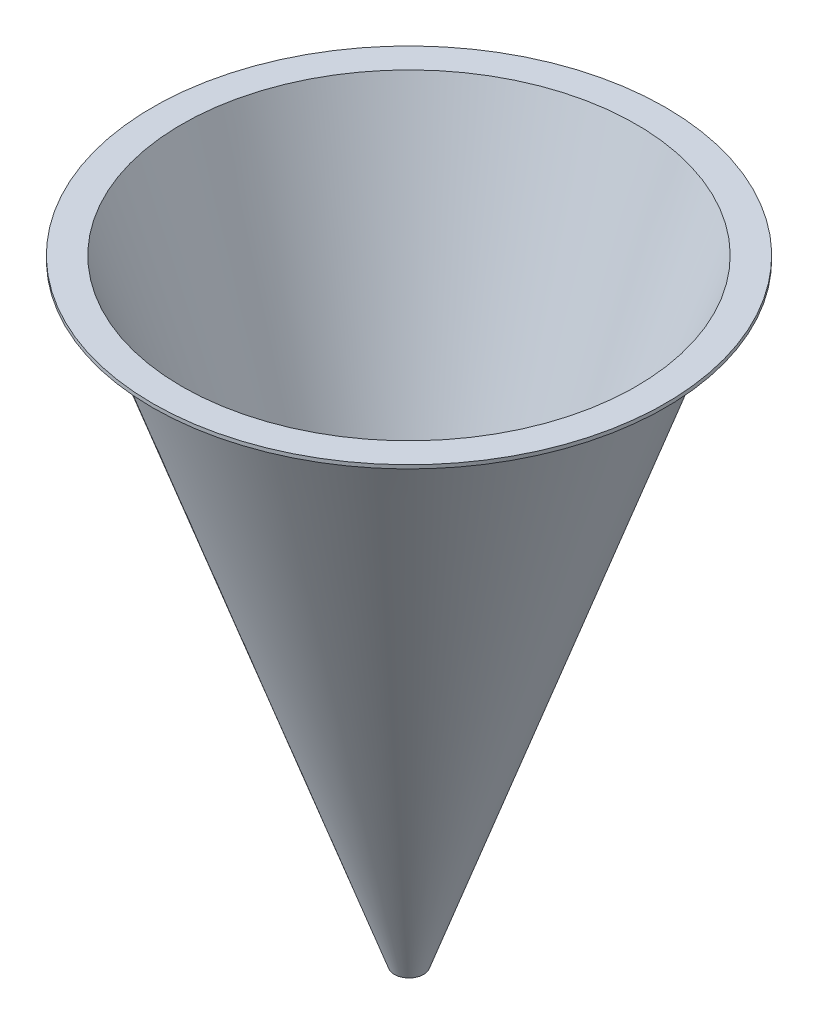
ISO-10303-21;
HEADER;
FILE_DESCRIPTION(('STEP AP214'),'2;1');
FILE_NAME('part.step','',(''),(''),'','','');
FILE_SCHEMA(('AUTOMOTIVE_DESIGN { 1 0 10303 214 1 1 1 1 }'));
ENDSEC;
DATA;
#1=APPLICATION_CONTEXT('core data for automotive mechanical design processes');
#2=APPLICATION_PROTOCOL_DEFINITION('international standard','automotive_design',2000,#1);
#3=PRODUCT_CONTEXT('',#1,'mechanical');
#4=PRODUCT('Part','Part','',(#3));
#5=PRODUCT_RELATED_PRODUCT_CATEGORY('part','',(#4));
#6=PRODUCT_DEFINITION_FORMATION('','',#4);
#7=PRODUCT_DEFINITION_CONTEXT('part definition',#1,'design');
#8=PRODUCT_DEFINITION('design','',#6,#7);
#9=PRODUCT_DEFINITION_SHAPE('','',#8);
#10=(LENGTH_UNIT() NAMED_UNIT(*) SI_UNIT(.MILLI.,.METRE.));
#11=(NAMED_UNIT(*) PLANE_ANGLE_UNIT() SI_UNIT($,.RADIAN.));
#12=(NAMED_UNIT(*) SI_UNIT($,.STERADIAN.) SOLID_ANGLE_UNIT());
#13=UNCERTAINTY_MEASURE_WITH_UNIT(LENGTH_MEASURE(1.E-05),#10,'distance_accuracy_value','');
#14=(GEOMETRIC_REPRESENTATION_CONTEXT(3) GLOBAL_UNCERTAINTY_ASSIGNED_CONTEXT((#13)) GLOBAL_UNIT_ASSIGNED_CONTEXT((#10,
#11,#12)) REPRESENTATION_CONTEXT('',''));
#15=CARTESIAN_POINT('',(0.,0.,0.));
#16=DIRECTION('',(0.,0.,1.));
#17=DIRECTION('',(1.,0.,0.));
#18=AXIS2_PLACEMENT_3D('',#15,#16,#17);
#19=CARTESIAN_POINT('',(0.,69.3998665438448,0.));
#20=DIRECTION('',(0.,1.,0.));
#21=DIRECTION('',(0.,0.,1.));
#22=AXIS2_PLACEMENT_3D('',#19,#20,#21);
#23=CYLINDRICAL_SURFACE('',#22,444.5);
#24=CARTESIAN_POINT('',(0.,0.,0.));
#25=DIRECTION('',(0.,1.,0.));
#26=DIRECTION('',(0.,0.,1.));
#27=AXIS2_PLACEMENT_3D('',#24,#25,#26);
#28=CIRCLE('',#27,444.5);
#29=CARTESIAN_POINT('',(0.,0.,444.5));
#30=VERTEX_POINT('',#29);
#31=EDGE_CURVE('E55',#30,#30,#28,.T.);
#32=ORIENTED_EDGE('',*,*,#31,.F.);
#33=EDGE_LOOP('',(#32));
#34=FACE_BOUND('',#33,.T.);
#35=CARTESIAN_POINT('',(0.,-6.35000000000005,0.));
#36=DIRECTION('',(0.,1.,0.));
#37=DIRECTION('',(0.,0.,1.));
#38=AXIS2_PLACEMENT_3D('',#35,#36,#37);
#39=CIRCLE('',#38,444.5);
#40=CARTESIAN_POINT('',(0.,-6.35000000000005,444.5));
#41=VERTEX_POINT('',#40);
#42=EDGE_CURVE('E10',#41,#41,#39,.T.);
#43=ORIENTED_EDGE('',*,*,#42,.T.);
#44=EDGE_LOOP('',(#43));
#45=FACE_BOUND('',#44,.T.);
#46=ADVANCED_FACE('F33',(#34,#45),#23,.T.);
#47=CARTESIAN_POINT('',(400.05,-6.35000000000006,0.));
#48=DIRECTION('',(0.,1.,0.));
#49=DIRECTION('',(0.,0.,1.));
#50=AXIS2_PLACEMENT_3D('',#47,#48,#49);
#51=PLANE('',#50);
#52=ORIENTED_EDGE('',*,*,#42,.F.);
#53=EDGE_LOOP('',(#52));
#54=FACE_BOUND('',#53,.T.);
#55=CARTESIAN_POINT('',(0.,-6.35000000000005,0.));
#56=DIRECTION('',(0.,1.,0.));
#57=DIRECTION('',(0.,0.,1.));
#58=AXIS2_PLACEMENT_3D('',#55,#56,#57);
#59=CIRCLE('',#58,400.05);
#60=CARTESIAN_POINT('',(0.,-6.34999999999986,400.05));
#61=VERTEX_POINT('',#60);
#62=EDGE_CURVE('E39',#61,#61,#59,.T.);
#63=ORIENTED_EDGE('',*,*,#62,.T.);
#64=EDGE_LOOP('',(#63));
#65=FACE_BOUND('',#64,.T.);
#66=ADVANCED_FACE('F62',(#54,#65),#51,.F.);
#67=CARTESIAN_POINT('',(0.,-1066.8,0.));
#68=DIRECTION('',(0.,1.,0.));
#69=DIRECTION('',(0.,0.,1.));
#70=AXIS2_PLACEMENT_3D('',#67,#68,#69);
#71=CONICAL_SURFACE('',#70,25.3999999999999,0.339605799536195);
#72=CARTESIAN_POINT('',(0.,-1066.8,0.));
#73=DIRECTION('',(0.,1.,0.));
#74=DIRECTION('',(0.,0.,1.));
#75=AXIS2_PLACEMENT_3D('',#72,#73,#74);
#76=CIRCLE('',#75,25.3999999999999);
#77=CARTESIAN_POINT('',(0.,-1066.8,25.3999999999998));
#78=VERTEX_POINT('',#77);
#79=EDGE_CURVE('E43',#78,#78,#76,.T.);
#80=CARTESIAN_POINT('',(0.,-6.34999999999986,400.05));
#81=CARTESIAN_POINT('',(0.,-17.3963541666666,396.147395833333));
#82=CARTESIAN_POINT('',(0.,-28.4427083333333,392.244791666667));
#83=CARTESIAN_POINT('',(0.,-50.5354166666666,384.439583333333));
#84=CARTESIAN_POINT('',(0.,-61.5817708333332,380.536979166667));
#85=CARTESIAN_POINT('',(0.,-83.6744791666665,372.731770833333));
#86=CARTESIAN_POINT('',(0.,-94.7208333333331,368.829166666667));
#87=CARTESIAN_POINT('',(0.,-116.813541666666,361.023958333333));
#88=CARTESIAN_POINT('',(0.,-127.859895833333,357.121354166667));
#89=CARTESIAN_POINT('',(0.,-149.952604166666,349.316145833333));
#90=CARTESIAN_POINT('',(0.,-160.998958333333,345.413541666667));
#91=CARTESIAN_POINT('',(0.,-183.091666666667,337.608333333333));
#92=CARTESIAN_POINT('',(0.,-194.138020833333,333.705729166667));
#93=CARTESIAN_POINT('',(0.,-216.230729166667,325.900520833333));
#94=CARTESIAN_POINT('',(0.,-227.277083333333,321.997916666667));
#95=CARTESIAN_POINT('',(0.,-249.369791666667,314.192708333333));
#96=CARTESIAN_POINT('',(0.,-260.416145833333,310.290104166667));
#97=CARTESIAN_POINT('',(0.,-282.508854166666,302.484895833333));
#98=CARTESIAN_POINT('',(0.,-293.555208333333,298.582291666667));
#99=CARTESIAN_POINT('',(0.,-315.647916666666,290.777083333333));
#100=CARTESIAN_POINT('',(0.,-326.694270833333,286.874479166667));
#101=CARTESIAN_POINT('',(0.,-348.786979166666,279.069270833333));
#102=CARTESIAN_POINT('',(0.,-359.833333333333,275.166666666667));
#103=CARTESIAN_POINT('',(0.,-381.926041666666,267.361458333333));
#104=CARTESIAN_POINT('',(0.,-392.972395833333,263.458854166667));
#105=CARTESIAN_POINT('',(0.,-415.065104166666,255.653645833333));
#106=CARTESIAN_POINT('',(0.,-426.111458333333,251.751041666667));
#107=CARTESIAN_POINT('',(0.,-448.204166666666,243.945833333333));
#108=CARTESIAN_POINT('',(0.,-459.250520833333,240.043229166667));
#109=CARTESIAN_POINT('',(0.,-481.343229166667,232.238020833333));
#110=CARTESIAN_POINT('',(0.,-492.389583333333,228.335416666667));
#111=CARTESIAN_POINT('',(0.,-514.482291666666,220.530208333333));
#112=CARTESIAN_POINT('',(0.,-525.528645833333,216.627604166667));
#113=CARTESIAN_POINT('',(0.,-547.621354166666,208.822395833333));
#114=CARTESIAN_POINT('',(0.,-558.667708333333,204.919791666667));
#115=CARTESIAN_POINT('',(0.,-580.760416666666,197.114583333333));
#116=CARTESIAN_POINT('',(0.,-591.806770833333,193.211979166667));
#117=CARTESIAN_POINT('',(0.,-613.899479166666,185.406770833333));
#118=CARTESIAN_POINT('',(0.,-624.945833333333,181.504166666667));
#119=CARTESIAN_POINT('',(0.,-647.038541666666,173.698958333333));
#120=CARTESIAN_POINT('',(0.,-658.084895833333,169.796354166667));
#121=CARTESIAN_POINT('',(0.,-680.177604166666,161.991145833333));
#122=CARTESIAN_POINT('',(0.,-691.223958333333,158.088541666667));
#123=CARTESIAN_POINT('',(0.,-713.316666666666,150.283333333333));
#124=CARTESIAN_POINT('',(0.,-724.363020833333,146.380729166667));
#125=CARTESIAN_POINT('',(0.,-746.455729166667,138.575520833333));
#126=CARTESIAN_POINT('',(0.,-757.502083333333,134.672916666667));
#127=CARTESIAN_POINT('',(0.,-779.594791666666,126.867708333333));
#128=CARTESIAN_POINT('',(0.,-790.641145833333,122.965104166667));
#129=CARTESIAN_POINT('',(0.,-812.733854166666,115.159895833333));
#130=CARTESIAN_POINT('',(0.,-823.780208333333,111.257291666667));
#131=CARTESIAN_POINT('',(0.,-845.872916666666,103.452083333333));
#132=CARTESIAN_POINT('',(0.,-856.919270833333,99.5494791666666));
#133=CARTESIAN_POINT('',(0.,-879.011979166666,91.7442708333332));
#134=CARTESIAN_POINT('',(0.,-890.058333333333,87.8416666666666));
#135=CARTESIAN_POINT('',(0.,-912.151041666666,80.0364583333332));
#136=CARTESIAN_POINT('',(0.,-923.197395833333,76.1338541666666));
#137=CARTESIAN_POINT('',(0.,-945.290104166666,68.3286458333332));
#138=CARTESIAN_POINT('',(0.,-956.336458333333,64.4260416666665));
#139=CARTESIAN_POINT('',(0.,-978.429166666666,56.6208333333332));
#140=CARTESIAN_POINT('',(0.,-989.475520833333,52.7182291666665));
#141=CARTESIAN_POINT('',(0.,-1011.56822916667,44.9130208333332));
#142=CARTESIAN_POINT('',(0.,-1022.61458333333,41.0104166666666));
#143=CARTESIAN_POINT('',(0.,-1044.70729166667,33.2052083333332));
#144=CARTESIAN_POINT('',(0.,-1055.75364583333,29.3026041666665));
#145=CARTESIAN_POINT('',(0.,-1066.8,25.3999999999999));
#146=B_SPLINE_CURVE_WITH_KNOTS('',3,(#80,#81,#82,#83,#84,#85,#86,#87,#88,#89,#90,#91,#92,#93,
#94,#95,#96,#97,#98,#99,#100,#101,#102,#103,#104,#105,#106,#107,#108,#109,#110,#111,#112,#113,
#114,#115,#116,#117,#118,#119,#120,#121,#122,#123,#124,#125,#126,#127,#128,#129,#130,#131,#132,
#133,#134,#135,#136,#137,#138,#139,#140,#141,#142,#143,#144,#145),.UNSPECIFIED.,.F.,.F.,(4,2,2,
2,2,2,2,2,2,2,2,2,2,2,2,2,2,2,2,2,2,2,2,2,2,2,2,2,2,2,2,2,4),(0.,35.1464128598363,
70.2928257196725,105.439238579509,140.585651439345,175.732064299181,210.878477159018,
246.024890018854,281.17130287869,316.317715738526,351.464128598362,386.610541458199,
421.756954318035,456.903367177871,492.049780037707,527.196192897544,562.34260575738,
597.489018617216,632.635431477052,667.781844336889,702.928257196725,738.074670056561,
773.221082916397,808.367495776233,843.51390863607,878.660321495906,913.806734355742,
948.953147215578,984.099560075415,1019.24597293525,1054.39238579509,1089.53879865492,
1124.68521151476),.UNSPECIFIED.);
#147=EDGE_CURVE('BSEAM66',#61,#78,#146,.T.);
#148=ORIENTED_EDGE('',*,*,#62,.F.);
#149=ORIENTED_EDGE('',*,*,#79,.T.);
#150=ORIENTED_EDGE('',*,*,#147,.T.);
#151=ORIENTED_EDGE('',*,*,#147,.F.);
#152=EDGE_LOOP('',(#148,#150,#149,#151));
#153=FACE_BOUND('',#152,.T.);
#154=ADVANCED_FACE('F66',(#153),#71,.T.);
#155=CARTESIAN_POINT('',(18.9934609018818,-1066.8,0.));
#156=DIRECTION('',(0.,1.,0.));
#157=DIRECTION('',(0.,0.,1.));
#158=AXIS2_PLACEMENT_3D('',#155,#156,#157);
#159=PLANE('',#158);
#160=ORIENTED_EDGE('',*,*,#79,.F.);
#161=EDGE_LOOP('',(#160));
#162=FACE_BOUND('',#161,.T.);
#163=CARTESIAN_POINT('',(0.,-1066.8,0.));
#164=DIRECTION('',(0.,1.,0.));
#165=DIRECTION('',(0.,0.,1.));
#166=AXIS2_PLACEMENT_3D('',#163,#164,#165);
#167=CIRCLE('',#166,18.9934609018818);
#168=CARTESIAN_POINT('',(0.,-1066.8,18.9934609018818));
#169=VERTEX_POINT('',#168);
#170=EDGE_CURVE('E47',#169,#169,#167,.T.);
#171=ORIENTED_EDGE('',*,*,#170,.T.);
#172=EDGE_LOOP('',(#171));
#173=FACE_BOUND('',#172,.T.);
#174=ADVANCED_FACE('F71',(#162,#173),#159,.F.);
#175=CARTESIAN_POINT('',(0.,0.,0.));
#176=DIRECTION('',(0.,1.,0.));
#177=DIRECTION('',(0.,0.,1.));
#178=AXIS2_PLACEMENT_3D('',#175,#176,#177);
#179=CONICAL_SURFACE('',#178,393.7,0.33778216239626);
#180=CARTESIAN_POINT('',(0.,0.,0.));
#181=DIRECTION('',(0.,1.,0.));
#182=DIRECTION('',(0.,0.,1.));
#183=AXIS2_PLACEMENT_3D('',#180,#181,#182);
#184=CIRCLE('',#183,393.7);
#185=CARTESIAN_POINT('',(0.,0.,393.7));
#186=VERTEX_POINT('',#185);
#187=EDGE_CURVE('E52',#186,#186,#184,.T.);
#188=CARTESIAN_POINT('',(0.,-1066.8,18.9934609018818));
#189=CARTESIAN_POINT('',(0.,-1055.6875,22.8966540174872));
#190=CARTESIAN_POINT('',(0.,-1044.575,26.7998471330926));
#191=CARTESIAN_POINT('',(0.,-1022.35,34.6062333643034));
#192=CARTESIAN_POINT('',(0.,-1011.2375,38.5094264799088));
#193=CARTESIAN_POINT('',(0.,-989.0125,46.3158127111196));
#194=CARTESIAN_POINT('',(0.,-977.9,50.219005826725));
#195=CARTESIAN_POINT('',(0.,-955.675,58.0253920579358));
#196=CARTESIAN_POINT('',(0.,-944.5625,61.9285851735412));
#197=CARTESIAN_POINT('',(0.,-922.3375,69.734971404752));
#198=CARTESIAN_POINT('',(0.,-911.225,73.6381645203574));
#199=CARTESIAN_POINT('',(0.,-889.,81.4445507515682));
#200=CARTESIAN_POINT('',(0.,-877.8875,85.3477438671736));
#201=CARTESIAN_POINT('',(0.,-855.6625,93.1541300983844));
#202=CARTESIAN_POINT('',(0.,-844.55,97.0573232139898));
#203=CARTESIAN_POINT('',(0.,-822.325,104.863709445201));
#204=CARTESIAN_POINT('',(0.,-811.2125,108.766902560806));
#205=CARTESIAN_POINT('',(0.,-788.9875,116.573288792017));
#206=CARTESIAN_POINT('',(0.,-777.875,120.476481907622));
#207=CARTESIAN_POINT('',(0.,-755.65,128.282868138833));
#208=CARTESIAN_POINT('',(0.,-744.5375,132.186061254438));
#209=CARTESIAN_POINT('',(0.,-722.3125,139.992447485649));
#210=CARTESIAN_POINT('',(0.,-711.2,143.895640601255));
#211=CARTESIAN_POINT('',(0.,-688.975,151.702026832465));
#212=CARTESIAN_POINT('',(0.,-677.8625,155.605219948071));
#213=CARTESIAN_POINT('',(0.,-655.6375,163.411606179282));
#214=CARTESIAN_POINT('',(0.,-644.525,167.314799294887));
#215=CARTESIAN_POINT('',(0.,-622.3,175.121185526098));
#216=CARTESIAN_POINT('',(0.,-611.1875,179.024378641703));
#217=CARTESIAN_POINT('',(0.,-588.9625,186.830764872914));
#218=CARTESIAN_POINT('',(0.,-577.85,190.733957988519));
#219=CARTESIAN_POINT('',(0.,-555.625,198.54034421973));
#220=CARTESIAN_POINT('',(0.,-544.5125,202.443537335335));
#221=CARTESIAN_POINT('',(0.,-522.2875,210.249923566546));
#222=CARTESIAN_POINT('',(0.,-511.175,214.153116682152));
#223=CARTESIAN_POINT('',(0.,-488.95,221.959502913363));
#224=CARTESIAN_POINT('',(0.,-477.8375,225.862696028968));
#225=CARTESIAN_POINT('',(0.,-455.6125,233.669082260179));
#226=CARTESIAN_POINT('',(0.,-444.5,237.572275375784));
#227=CARTESIAN_POINT('',(0.,-422.275,245.378661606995));
#228=CARTESIAN_POINT('',(0.,-411.1625,249.2818547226));
#229=CARTESIAN_POINT('',(0.,-388.9375,257.088240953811));
#230=CARTESIAN_POINT('',(0.,-377.825,260.991434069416));
#231=CARTESIAN_POINT('',(0.,-355.6,268.797820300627));
#232=CARTESIAN_POINT('',(0.,-344.4875,272.701013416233));
#233=CARTESIAN_POINT('',(0.,-322.2625,280.507399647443));
#234=CARTESIAN_POINT('',(0.,-311.15,284.410592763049));
#235=CARTESIAN_POINT('',(0.,-288.925,292.21697899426));
#236=CARTESIAN_POINT('',(0.,-277.8125,296.120172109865));
#237=CARTESIAN_POINT('',(0.,-255.5875,303.926558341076));
#238=CARTESIAN_POINT('',(0.,-244.475,307.829751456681));
#239=CARTESIAN_POINT('',(0.,-222.25,315.636137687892));
#240=CARTESIAN_POINT('',(0.,-211.1375,319.539330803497));
#241=CARTESIAN_POINT('',(0.,-188.9125,327.345717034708));
#242=CARTESIAN_POINT('',(0.,-177.8,331.248910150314));
#243=CARTESIAN_POINT('',(0.,-155.575,339.055296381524));
#244=CARTESIAN_POINT('',(0.,-144.4625,342.95848949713));
#245=CARTESIAN_POINT('',(0.,-122.2375,350.764875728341));
#246=CARTESIAN_POINT('',(0.,-111.125,354.668068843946));
#247=CARTESIAN_POINT('',(0.,-88.9,362.474455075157));
#248=CARTESIAN_POINT('',(0.,-77.7875,366.377648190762));
#249=CARTESIAN_POINT('',(0.,-55.5625,374.184034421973));
#250=CARTESIAN_POINT('',(0.,-44.45,378.087227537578));
#251=CARTESIAN_POINT('',(0.,-22.225,385.893613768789));
#252=CARTESIAN_POINT('',(0.,-11.1125,389.796806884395));
#253=CARTESIAN_POINT('',(0.,0.,393.7));
#254=B_SPLINE_CURVE_WITH_KNOTS('',3,(#188,#189,#190,#191,#192,#193,#194,#195,#196,#197,#198,
#199,#200,#201,#202,#203,#204,#205,#206,#207,#208,#209,#210,#211,#212,#213,#214,#215,#216,#217,
#218,#219,#220,#221,#222,#223,#224,#225,#226,#227,#228,#229,#230,#231,#232,#233,#234,#235,#236,
#237,#238,#239,#240,#241,#242,#243,#244,#245,#246,#247,#248,#249,#250,#251,#252,#253),
.UNSPECIFIED.,.F.,.F.,(4,2,2,2,2,2,2,2,2,2,2,2,2,2,2,2,2,2,2,2,2,2,2,2,2,2,2,2,2,2,2,2,4),(0.,
35.334164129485,70.66832825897,106.002492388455,141.33665651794,176.670820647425,
212.00498477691,247.339148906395,282.67331303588,318.007477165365,353.34164129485,
388.675805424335,424.00996955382,459.344133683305,494.67829781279,530.012461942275,
565.34662607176,600.680790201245,636.01495433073,671.349118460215,706.6832825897,
742.017446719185,777.35161084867,812.685774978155,848.01993910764,883.354103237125,
918.68826736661,954.022431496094,989.356595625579,1024.69075975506,1060.02492388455,
1095.35908801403,1130.69325214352),.UNSPECIFIED.);
#255=EDGE_CURVE('BSEAM77',#169,#186,#254,.T.);
#256=ORIENTED_EDGE('',*,*,#170,.F.);
#257=ORIENTED_EDGE('',*,*,#187,.T.);
#258=ORIENTED_EDGE('',*,*,#255,.T.);
#259=ORIENTED_EDGE('',*,*,#255,.F.);
#260=EDGE_LOOP('',(#256,#258,#257,#259));
#261=FACE_BOUND('',#260,.T.);
#262=ADVANCED_FACE('F77',(#261),#179,.F.);
#263=CARTESIAN_POINT('',(444.5,0.,0.));
#264=DIRECTION('',(0.,-1.,0.));
#265=DIRECTION('',(0.,0.,-1.));
#266=AXIS2_PLACEMENT_3D('',#263,#264,#265);
#267=PLANE('',#266);
#268=ORIENTED_EDGE('',*,*,#187,.F.);
#269=EDGE_LOOP('',(#268));
#270=FACE_BOUND('',#269,.T.);
#271=ORIENTED_EDGE('',*,*,#31,.T.);
#272=EDGE_LOOP('',(#271));
#273=FACE_BOUND('',#272,.T.);
#274=ADVANCED_FACE('F59',(#270,#273),#267,.F.);
#275=CLOSED_SHELL('',(#46,#66,#154,#174,#262,#274));
#276=MANIFOLD_SOLID_BREP('B2',#275);
#277=ADVANCED_BREP_SHAPE_REPRESENTATION('',(#18,#276),#14);
#278=SHAPE_DEFINITION_REPRESENTATION(#9,#277);
ENDSEC;
END-ISO-10303-21;
